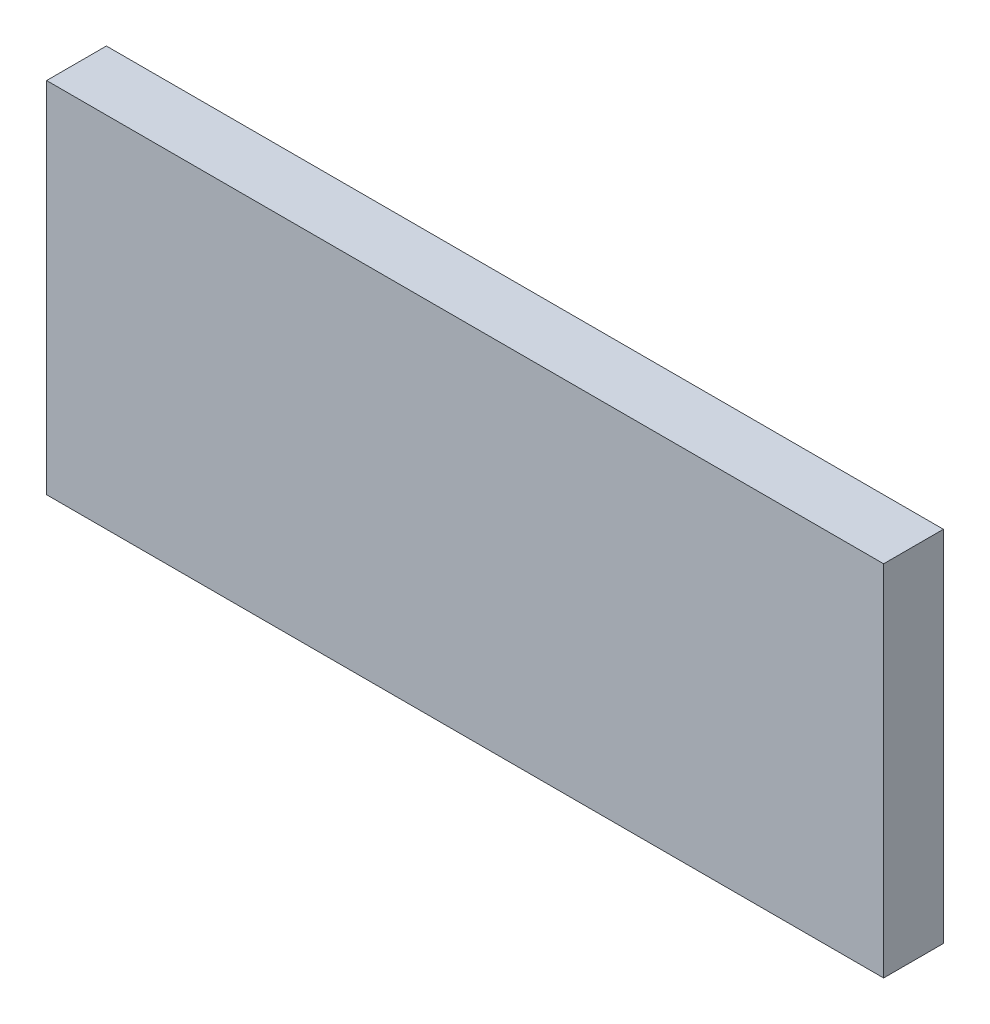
ISO-10303-21;
HEADER;
FILE_DESCRIPTION(('STEP AP214'),'2;1');
FILE_NAME('part.step','',(''),(''),'','','');
FILE_SCHEMA(('AUTOMOTIVE_DESIGN { 1 0 10303 214 1 1 1 1 }'));
ENDSEC;
DATA;
#1=APPLICATION_CONTEXT('core data for automotive mechanical design processes');
#2=APPLICATION_PROTOCOL_DEFINITION('international standard','automotive_design',2000,#1);
#3=PRODUCT_CONTEXT('',#1,'mechanical');
#4=PRODUCT('Part','Part','',(#3));
#5=PRODUCT_RELATED_PRODUCT_CATEGORY('part','',(#4));
#6=PRODUCT_DEFINITION_FORMATION('','',#4);
#7=PRODUCT_DEFINITION_CONTEXT('part definition',#1,'design');
#8=PRODUCT_DEFINITION('design','',#6,#7);
#9=PRODUCT_DEFINITION_SHAPE('','',#8);
#10=(LENGTH_UNIT() NAMED_UNIT(*) SI_UNIT(.MILLI.,.METRE.));
#11=(NAMED_UNIT(*) PLANE_ANGLE_UNIT() SI_UNIT($,.RADIAN.));
#12=(NAMED_UNIT(*) SI_UNIT($,.STERADIAN.) SOLID_ANGLE_UNIT());
#13=UNCERTAINTY_MEASURE_WITH_UNIT(LENGTH_MEASURE(1.E-05),#10,'distance_accuracy_value','');
#14=(GEOMETRIC_REPRESENTATION_CONTEXT(3) GLOBAL_UNCERTAINTY_ASSIGNED_CONTEXT((#13)) GLOBAL_UNIT_ASSIGNED_CONTEXT((#10,
#11,#12)) REPRESENTATION_CONTEXT('',''));
#15=CARTESIAN_POINT('',(0.,0.,0.));
#16=DIRECTION('',(0.,0.,1.));
#17=DIRECTION('',(1.,0.,0.));
#18=AXIS2_PLACEMENT_3D('',#15,#16,#17);
#19=CARTESIAN_POINT('',(0.,0.,12.7));
#20=DIRECTION('',(1.,0.,0.));
#21=DIRECTION('',(0.,0.,-1.));
#22=AXIS2_PLACEMENT_3D('',#19,#20,#21);
#23=PLANE('',#22);
#24=DIRECTION('',(0.,-1.,0.));
#25=VECTOR('',#24,1.);
#26=CARTESIAN_POINT('',(0.,0.,0.));
#27=LINE('',#26,#25);
#28=CARTESIAN_POINT('',(0.,76.2,0.));
#29=VERTEX_POINT('',#28);
#30=CARTESIAN_POINT('',(0.,0.,0.));
#31=VERTEX_POINT('',#30);
#32=EDGE_CURVE('E94',#29,#31,#27,.T.);
#33=ORIENTED_EDGE('',*,*,#32,.T.);
#34=DIRECTION('',(0.,0.,-1.));
#35=VECTOR('',#34,1.);
#36=CARTESIAN_POINT('',(0.,0.,12.7));
#37=LINE('',#36,#35);
#38=CARTESIAN_POINT('',(0.,0.,12.7));
#39=VERTEX_POINT('',#38);
#40=EDGE_CURVE('E11',#39,#31,#37,.T.);
#41=ORIENTED_EDGE('',*,*,#40,.F.);
#42=DIRECTION('',(0.,-1.,0.));
#43=VECTOR('',#42,1.);
#44=CARTESIAN_POINT('',(0.,0.,12.7));
#45=LINE('',#44,#43);
#46=CARTESIAN_POINT('',(0.,76.2,12.7));
#47=VERTEX_POINT('',#46);
#48=EDGE_CURVE('E82',#47,#39,#45,.T.);
#49=ORIENTED_EDGE('',*,*,#48,.F.);
#50=DIRECTION('',(0.,0.,-1.));
#51=VECTOR('',#50,1.);
#52=CARTESIAN_POINT('',(0.,76.2,12.7));
#53=LINE('',#52,#51);
#54=EDGE_CURVE('E90',#47,#29,#53,.T.);
#55=ORIENTED_EDGE('',*,*,#54,.T.);
#56=EDGE_LOOP('',(#33,#41,#49,#55));
#57=FACE_BOUND('',#56,.T.);
#58=ADVANCED_FACE('F31',(#57),#23,.F.);
#59=CARTESIAN_POINT('',(0.,0.,12.7));
#60=DIRECTION('',(0.,1.,0.));
#61=DIRECTION('',(0.,0.,1.));
#62=AXIS2_PLACEMENT_3D('',#59,#60,#61);
#63=PLANE('',#62);
#64=DIRECTION('',(1.,0.,0.));
#65=VECTOR('',#64,1.);
#66=CARTESIAN_POINT('',(0.,0.,0.));
#67=LINE('',#66,#65);
#68=CARTESIAN_POINT('',(177.8,0.,0.));
#69=VERTEX_POINT('',#68);
#70=EDGE_CURVE('E86',#31,#69,#67,.T.);
#71=ORIENTED_EDGE('',*,*,#70,.T.);
#72=DIRECTION('',(0.,0.,-1.));
#73=VECTOR('',#72,1.);
#74=CARTESIAN_POINT('',(177.8,0.,12.7));
#75=LINE('',#74,#73);
#76=CARTESIAN_POINT('',(177.8,0.,12.7));
#77=VERTEX_POINT('',#76);
#78=EDGE_CURVE('E39',#77,#69,#75,.T.);
#79=ORIENTED_EDGE('',*,*,#78,.F.);
#80=DIRECTION('',(1.,0.,0.));
#81=VECTOR('',#80,1.);
#82=CARTESIAN_POINT('',(0.,0.,12.7));
#83=LINE('',#82,#81);
#84=EDGE_CURVE('E77',#39,#77,#83,.T.);
#85=ORIENTED_EDGE('',*,*,#84,.F.);
#86=ORIENTED_EDGE('',*,*,#40,.T.);
#87=EDGE_LOOP('',(#71,#79,#85,#86));
#88=FACE_BOUND('',#87,.T.);
#89=ADVANCED_FACE('F85',(#88),#63,.F.);
#90=CARTESIAN_POINT('',(177.8,0.,12.7));
#91=DIRECTION('',(-1.,0.,0.));
#92=DIRECTION('',(0.,0.,1.));
#93=AXIS2_PLACEMENT_3D('',#90,#91,#92);
#94=PLANE('',#93);
#95=DIRECTION('',(0.,1.,0.));
#96=VECTOR('',#95,1.);
#97=CARTESIAN_POINT('',(177.8,0.,0.));
#98=LINE('',#97,#96);
#99=CARTESIAN_POINT('',(177.8,76.2,0.));
#100=VERTEX_POINT('',#99);
#101=EDGE_CURVE('E64',#69,#100,#98,.T.);
#102=ORIENTED_EDGE('',*,*,#101,.T.);
#103=DIRECTION('',(0.,0.,-1.));
#104=VECTOR('',#103,1.);
#105=CARTESIAN_POINT('',(177.8,76.2,12.7));
#106=LINE('',#105,#104);
#107=CARTESIAN_POINT('',(177.8,76.2,12.7));
#108=VERTEX_POINT('',#107);
#109=EDGE_CURVE('E87',#108,#100,#106,.T.);
#110=ORIENTED_EDGE('',*,*,#109,.F.);
#111=DIRECTION('',(0.,1.,0.));
#112=VECTOR('',#111,1.);
#113=CARTESIAN_POINT('',(177.8,0.,12.7));
#114=LINE('',#113,#112);
#115=EDGE_CURVE('E80',#77,#108,#114,.T.);
#116=ORIENTED_EDGE('',*,*,#115,.F.);
#117=ORIENTED_EDGE('',*,*,#78,.T.);
#118=EDGE_LOOP('',(#102,#110,#116,#117));
#119=FACE_BOUND('',#118,.T.);
#120=ADVANCED_FACE('F88',(#119),#94,.F.);
#121=CARTESIAN_POINT('',(0.,76.2,12.7));
#122=DIRECTION('',(0.,-1.,0.));
#123=DIRECTION('',(0.,0.,-1.));
#124=AXIS2_PLACEMENT_3D('',#121,#122,#123);
#125=PLANE('',#124);
#126=DIRECTION('',(-1.,0.,0.));
#127=VECTOR('',#126,1.);
#128=CARTESIAN_POINT('',(0.,76.2,0.));
#129=LINE('',#128,#127);
#130=EDGE_CURVE('E70',#100,#29,#129,.T.);
#131=ORIENTED_EDGE('',*,*,#130,.T.);
#132=ORIENTED_EDGE('',*,*,#54,.F.);
#133=DIRECTION('',(-1.,0.,0.));
#134=VECTOR('',#133,1.);
#135=CARTESIAN_POINT('',(0.,76.2,12.7));
#136=LINE('',#135,#134);
#137=EDGE_CURVE('E47',#108,#47,#136,.T.);
#138=ORIENTED_EDGE('',*,*,#137,.F.);
#139=ORIENTED_EDGE('',*,*,#109,.T.);
#140=EDGE_LOOP('',(#131,#132,#138,#139));
#141=FACE_BOUND('',#140,.T.);
#142=ADVANCED_FACE('F101',(#141),#125,.F.);
#143=CARTESIAN_POINT('',(0.,76.2,12.7));
#144=DIRECTION('',(0.,0.,-1.));
#145=DIRECTION('',(-1.,0.,0.));
#146=AXIS2_PLACEMENT_3D('',#143,#144,#145);
#147=PLANE('',#146);
#148=ORIENTED_EDGE('',*,*,#48,.T.);
#149=ORIENTED_EDGE('',*,*,#84,.T.);
#150=ORIENTED_EDGE('',*,*,#115,.T.);
#151=ORIENTED_EDGE('',*,*,#137,.T.);
#152=EDGE_LOOP('',(#148,#149,#150,#151));
#153=FACE_BOUND('',#152,.T.);
#154=ADVANCED_FACE('F78',(#153),#147,.F.);
#155=CARTESIAN_POINT('',(0.,76.2,0.));
#156=DIRECTION('',(0.,0.,-1.));
#157=DIRECTION('',(-1.,0.,0.));
#158=AXIS2_PLACEMENT_3D('',#155,#156,#157);
#159=PLANE('',#158);
#160=ORIENTED_EDGE('',*,*,#32,.F.);
#161=ORIENTED_EDGE('',*,*,#130,.F.);
#162=ORIENTED_EDGE('',*,*,#101,.F.);
#163=ORIENTED_EDGE('',*,*,#70,.F.);
#164=EDGE_LOOP('',(#160,#161,#162,#163));
#165=FACE_BOUND('',#164,.T.);
#166=ADVANCED_FACE('F104',(#165),#159,.T.);
#167=CLOSED_SHELL('',(#58,#89,#120,#142,#154,#166));
#168=MANIFOLD_SOLID_BREP('B2',#167);
#169=ADVANCED_BREP_SHAPE_REPRESENTATION('',(#18,#168),#14);
#170=SHAPE_DEFINITION_REPRESENTATION(#9,#169);
ENDSEC;
END-ISO-10303-21;
